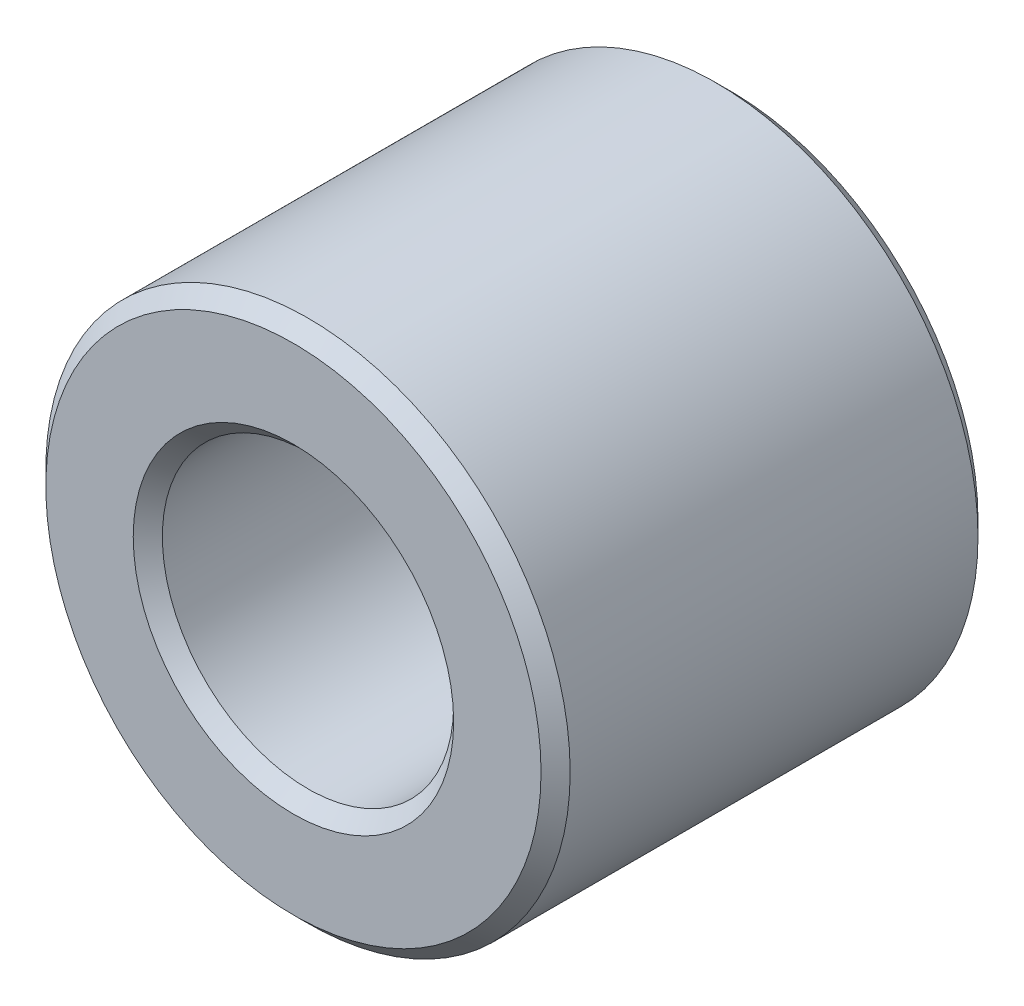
from build123d import *

# Parameters (mm, degrees)
SKETCH1_R           = 45
SKETCH1_R_2         = 25
BOSS_EXTRUDE1_DEPTH = 37.5
CHAMFER1_SIZE       = 2.5


with BuildPart() as part:
    # Sketch1 → Boss-Extrude1 (new, symmetric)
    with BuildSketch(Plane.XY):
        Circle(SKETCH1_R)
        Circle(SKETCH1_R_2, mode=Mode.SUBTRACT)
    extrude(amount=BOSS_EXTRUDE1_DEPTH, both=True)

    # Chamfer1
    chamfer1_edges = [part.edges().sort_by_distance(p)[0] for p in [
        (-45, 0, -37.5),
        (-45, 0, 37.5),
        (-25, 0, -37.5),
        (-25, 0, 37.5),
    ]]
    chamfer(chamfer1_edges, length=CHAMFER1_SIZE)


solid = part.part
